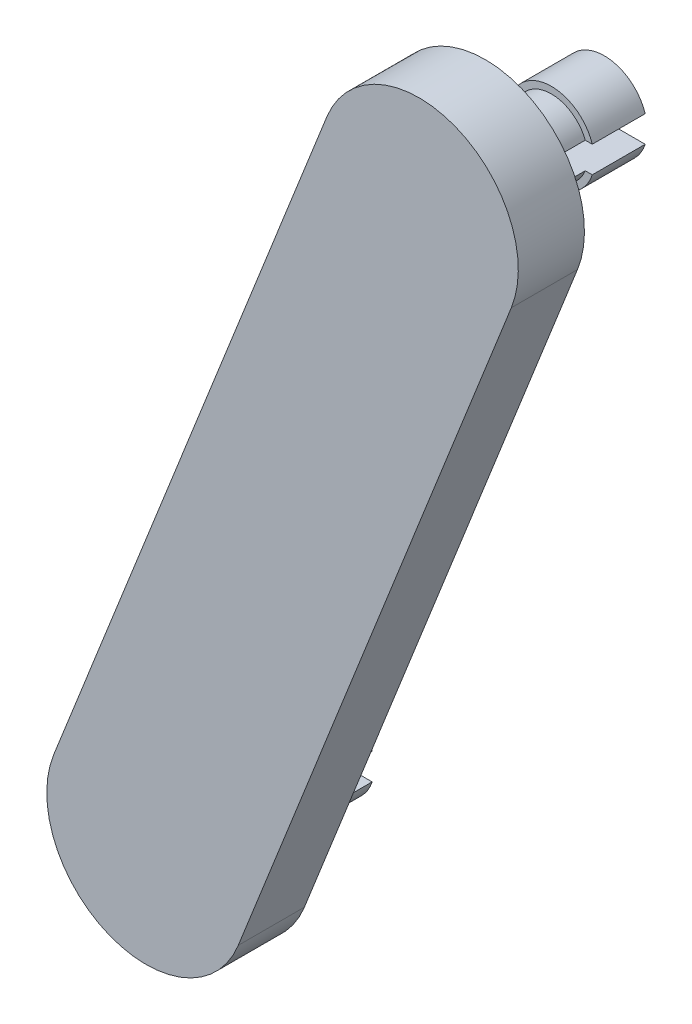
ISO-10303-21;
HEADER;
FILE_DESCRIPTION(('STEP AP214'),'2;1');
FILE_NAME('part.step','',(''),(''),'','','');
FILE_SCHEMA(('AUTOMOTIVE_DESIGN { 1 0 10303 214 1 1 1 1 }'));
ENDSEC;
DATA;
#1=APPLICATION_CONTEXT('core data for automotive mechanical design processes');
#2=APPLICATION_PROTOCOL_DEFINITION('international standard','automotive_design',2000,#1);
#3=PRODUCT_CONTEXT('',#1,'mechanical');
#4=PRODUCT('Part','Part','',(#3));
#5=PRODUCT_RELATED_PRODUCT_CATEGORY('part','',(#4));
#6=PRODUCT_DEFINITION_FORMATION('','',#4);
#7=PRODUCT_DEFINITION_CONTEXT('part definition',#1,'design');
#8=PRODUCT_DEFINITION('design','',#6,#7);
#9=PRODUCT_DEFINITION_SHAPE('','',#8);
#10=(LENGTH_UNIT() NAMED_UNIT(*) SI_UNIT(.MILLI.,.METRE.));
#11=(NAMED_UNIT(*) PLANE_ANGLE_UNIT() SI_UNIT($,.RADIAN.));
#12=(NAMED_UNIT(*) SI_UNIT($,.STERADIAN.) SOLID_ANGLE_UNIT());
#13=UNCERTAINTY_MEASURE_WITH_UNIT(LENGTH_MEASURE(1.E-05),#10,'distance_accuracy_value','');
#14=(GEOMETRIC_REPRESENTATION_CONTEXT(3) GLOBAL_UNCERTAINTY_ASSIGNED_CONTEXT((#13)) GLOBAL_UNIT_ASSIGNED_CONTEXT((#10,
#11,#12)) REPRESENTATION_CONTEXT('',''));
#15=CARTESIAN_POINT('',(0.,0.,0.));
#16=DIRECTION('',(0.,0.,1.));
#17=DIRECTION('',(1.,0.,0.));
#18=AXIS2_PLACEMENT_3D('',#15,#16,#17);
#19=CARTESIAN_POINT('',(-117.669847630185,11.9858517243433,-5.));
#20=DIRECTION('',(0.,0.,1.));
#21=DIRECTION('',(1.,0.,0.));
#22=AXIS2_PLACEMENT_3D('',#19,#20,#21);
#23=CYLINDRICAL_SURFACE('',#22,2.75000000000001);
#24=DIRECTION('',(0.,0.,1.));
#25=VECTOR('',#24,1.);
#26=CARTESIAN_POINT('',(-120.231585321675,12.9858517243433,-5.));
#27=LINE('',#26,#25);
#28=CARTESIAN_POINT('',(-120.231585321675,12.9858517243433,0.));
#29=VERTEX_POINT('',#28);
#30=CARTESIAN_POINT('',(-120.231585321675,12.9858517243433,-5.));
#31=VERTEX_POINT('',#30);
#32=EDGE_CURVE('E194',#29,#31,#27,.F.);
#33=ORIENTED_EDGE('',*,*,#32,.F.);
#34=CARTESIAN_POINT('',(-117.669847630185,11.9858517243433,0.));
#35=DIRECTION('',(0.,0.,1.));
#36=DIRECTION('',(1.,0.,0.));
#37=AXIS2_PLACEMENT_3D('',#34,#35,#36);
#38=CIRCLE('',#37,2.75000000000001);
#39=CARTESIAN_POINT('',(-115.108109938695,12.9858517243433,0.));
#40=VERTEX_POINT('',#39);
#41=EDGE_CURVE('E224',#40,#29,#38,.T.);
#42=ORIENTED_EDGE('',*,*,#41,.F.);
#43=DIRECTION('',(0.,0.,1.));
#44=VECTOR('',#43,1.);
#45=CARTESIAN_POINT('',(-115.108109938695,12.9858517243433,-5.));
#46=LINE('',#45,#44);
#47=CARTESIAN_POINT('',(-115.108109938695,12.9858517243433,-5.));
#48=VERTEX_POINT('',#47);
#49=EDGE_CURVE('E305',#48,#40,#46,.T.);
#50=ORIENTED_EDGE('',*,*,#49,.F.);
#51=CARTESIAN_POINT('',(-117.669847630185,11.9858517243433,-5.));
#52=DIRECTION('',(0.,0.,1.));
#53=DIRECTION('',(1.,0.,0.));
#54=AXIS2_PLACEMENT_3D('',#51,#52,#53);
#55=CIRCLE('',#54,2.75000000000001);
#56=EDGE_CURVE('E221',#48,#31,#55,.T.);
#57=ORIENTED_EDGE('',*,*,#56,.T.);
#58=EDGE_LOOP('',(#33,#42,#50,#57));
#59=FACE_BOUND('',#58,.T.);
#60=ADVANCED_FACE('F37',(#59),#23,.T.);
#61=CARTESIAN_POINT('',(-138.309294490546,-40.0719357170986,-5.));
#62=DIRECTION('',(0.,0.,1.));
#63=DIRECTION('',(1.,0.,0.));
#64=AXIS2_PLACEMENT_3D('',#61,#62,#63);
#65=CYLINDRICAL_SURFACE('',#64,2.75000000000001);
#66=DIRECTION('',(0.,0.,1.));
#67=VECTOR('',#66,1.);
#68=CARTESIAN_POINT('',(-140.871032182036,-39.0719357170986,-5.));
#69=LINE('',#68,#67);
#70=CARTESIAN_POINT('',(-140.871032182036,-39.0719357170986,0.));
#71=VERTEX_POINT('',#70);
#72=CARTESIAN_POINT('',(-140.871032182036,-39.0719357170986,-5.));
#73=VERTEX_POINT('',#72);
#74=EDGE_CURVE('E282',#71,#73,#69,.F.);
#75=ORIENTED_EDGE('',*,*,#74,.F.);
#76=CARTESIAN_POINT('',(-138.309294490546,-40.0719357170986,0.));
#77=DIRECTION('',(0.,0.,1.));
#78=DIRECTION('',(1.,0.,0.));
#79=AXIS2_PLACEMENT_3D('',#76,#77,#78);
#80=CIRCLE('',#79,2.75000000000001);
#81=CARTESIAN_POINT('',(-135.747556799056,-39.0719357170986,0.));
#82=VERTEX_POINT('',#81);
#83=EDGE_CURVE('E212',#82,#71,#80,.T.);
#84=ORIENTED_EDGE('',*,*,#83,.F.);
#85=DIRECTION('',(0.,0.,1.));
#86=VECTOR('',#85,1.);
#87=CARTESIAN_POINT('',(-135.747556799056,-39.0719357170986,-5.));
#88=LINE('',#87,#86);
#89=CARTESIAN_POINT('',(-135.747556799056,-39.0719357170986,-5.));
#90=VERTEX_POINT('',#89);
#91=EDGE_CURVE('E283',#90,#82,#88,.T.);
#92=ORIENTED_EDGE('',*,*,#91,.F.);
#93=CARTESIAN_POINT('',(-138.309294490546,-40.0719357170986,-5.));
#94=DIRECTION('',(0.,0.,1.));
#95=DIRECTION('',(1.,0.,0.));
#96=AXIS2_PLACEMENT_3D('',#93,#94,#95);
#97=CIRCLE('',#96,2.75000000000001);
#98=EDGE_CURVE('E217',#90,#73,#97,.T.);
#99=ORIENTED_EDGE('',*,*,#98,.T.);
#100=EDGE_LOOP('',(#75,#84,#92,#99));
#101=FACE_BOUND('',#100,.T.);
#102=ADVANCED_FACE('F280',(#101),#65,.T.);
#103=CARTESIAN_POINT('',(-117.669847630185,11.9858517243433,-9.));
#104=DIRECTION('',(0.,0.,1.));
#105=DIRECTION('',(1.,0.,0.));
#106=AXIS2_PLACEMENT_3D('',#103,#104,#105);
#107=CYLINDRICAL_SURFACE('',#106,3.25000000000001);
#108=CARTESIAN_POINT('',(-117.669847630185,11.9858517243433,-9.));
#109=DIRECTION('',(0.,0.,-1.));
#110=DIRECTION('',(-1.,0.,0.));
#111=AXIS2_PLACEMENT_3D('',#108,#109,#110);
#112=CIRCLE('',#111,3.25000000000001);
#113=CARTESIAN_POINT('',(-120.762176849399,12.9858517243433,-9.));
#114=VERTEX_POINT('',#113);
#115=CARTESIAN_POINT('',(-114.577518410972,12.9858517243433,-9.));
#116=VERTEX_POINT('',#115);
#117=EDGE_CURVE('E203',#114,#116,#112,.T.);
#118=ORIENTED_EDGE('',*,*,#117,.F.);
#119=DIRECTION('',(0.,0.,1.));
#120=VECTOR('',#119,1.);
#121=CARTESIAN_POINT('',(-120.762176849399,12.9858517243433,-9.));
#122=LINE('',#121,#120);
#123=CARTESIAN_POINT('',(-120.762176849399,12.9858517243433,-5.));
#124=VERTEX_POINT('',#123);
#125=EDGE_CURVE('E198',#114,#124,#122,.T.);
#126=ORIENTED_EDGE('',*,*,#125,.T.);
#127=CARTESIAN_POINT('',(-117.669847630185,11.9858517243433,-5.));
#128=DIRECTION('',(0.,0.,-1.));
#129=DIRECTION('',(-1.,0.,0.));
#130=AXIS2_PLACEMENT_3D('',#127,#128,#129);
#131=CIRCLE('',#130,3.25000000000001);
#132=CARTESIAN_POINT('',(-114.577518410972,12.9858517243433,-5.));
#133=VERTEX_POINT('',#132);
#134=EDGE_CURVE('E208',#124,#133,#131,.T.);
#135=ORIENTED_EDGE('',*,*,#134,.T.);
#136=DIRECTION('',(0.,0.,1.));
#137=VECTOR('',#136,1.);
#138=CARTESIAN_POINT('',(-114.577518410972,12.9858517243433,-9.));
#139=LINE('',#138,#137);
#140=EDGE_CURVE('E302',#133,#116,#139,.F.);
#141=ORIENTED_EDGE('',*,*,#140,.T.);
#142=EDGE_LOOP('',(#118,#126,#135,#141));
#143=FACE_BOUND('',#142,.T.);
#144=ADVANCED_FACE('F311',(#143),#107,.T.);
#145=CARTESIAN_POINT('',(-117.669847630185,11.9858517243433,-9.));
#146=DIRECTION('',(0.,0.,-1.));
#147=DIRECTION('',(-1.,0.,0.));
#148=AXIS2_PLACEMENT_3D('',#145,#146,#147);
#149=PLANE('',#148);
#150=DIRECTION('',(1.,0.,0.));
#151=VECTOR('',#150,1.);
#152=CARTESIAN_POINT('',(-112.669847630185,12.9858517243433,-9.));
#153=LINE('',#152,#151);
#154=EDGE_CURVE('E331',#114,#116,#153,.T.);
#155=ORIENTED_EDGE('',*,*,#154,.F.);
#156=ORIENTED_EDGE('',*,*,#117,.T.);
#157=EDGE_LOOP('',(#155,#156));
#158=FACE_BOUND('',#157,.T.);
#159=ADVANCED_FACE('F371',(#158),#149,.T.);
#160=CARTESIAN_POINT('',(-117.669847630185,11.9858517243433,-5.));
#161=DIRECTION('',(0.,0.,-1.));
#162=DIRECTION('',(-1.,0.,0.));
#163=AXIS2_PLACEMENT_3D('',#160,#161,#162);
#164=PLANE('',#163);
#165=ORIENTED_EDGE('',*,*,#134,.F.);
#166=DIRECTION('',(1.,0.,0.));
#167=VECTOR('',#166,1.);
#168=CARTESIAN_POINT('',(-117.669847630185,12.9858517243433,-5.));
#169=LINE('',#168,#167);
#170=EDGE_CURVE('E11',#124,#31,#169,.T.);
#171=ORIENTED_EDGE('',*,*,#170,.T.);
#172=ORIENTED_EDGE('',*,*,#56,.F.);
#173=EDGE_CURVE('E41',#48,#133,#169,.T.);
#174=ORIENTED_EDGE('',*,*,#173,.T.);
#175=EDGE_LOOP('',(#165,#171,#172,#174));
#176=FACE_BOUND('',#175,.T.);
#177=ADVANCED_FACE('F316',(#176),#164,.F.);
#178=CARTESIAN_POINT('',(-138.309294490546,-40.0719357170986,-9.));
#179=DIRECTION('',(0.,0.,1.));
#180=DIRECTION('',(1.,0.,0.));
#181=AXIS2_PLACEMENT_3D('',#178,#179,#180);
#182=CYLINDRICAL_SURFACE('',#181,3.25000000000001);
#183=CARTESIAN_POINT('',(-138.309294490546,-40.0719357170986,-9.));
#184=DIRECTION('',(0.,0.,-1.));
#185=DIRECTION('',(-1.,0.,0.));
#186=AXIS2_PLACEMENT_3D('',#183,#184,#185);
#187=CIRCLE('',#186,3.25000000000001);
#188=CARTESIAN_POINT('',(-141.401623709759,-39.0719357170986,-9.));
#189=VERTEX_POINT('',#188);
#190=CARTESIAN_POINT('',(-135.216965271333,-39.0719357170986,-9.));
#191=VERTEX_POINT('',#190);
#192=EDGE_CURVE('E193',#189,#191,#187,.T.);
#193=ORIENTED_EDGE('',*,*,#192,.F.);
#194=DIRECTION('',(0.,0.,1.));
#195=VECTOR('',#194,1.);
#196=CARTESIAN_POINT('',(-141.401623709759,-39.0719357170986,-9.));
#197=LINE('',#196,#195);
#198=CARTESIAN_POINT('',(-141.401623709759,-39.0719357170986,-5.));
#199=VERTEX_POINT('',#198);
#200=EDGE_CURVE('E285',#189,#199,#197,.T.);
#201=ORIENTED_EDGE('',*,*,#200,.T.);
#202=CARTESIAN_POINT('',(-138.309294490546,-40.0719357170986,-5.));
#203=DIRECTION('',(0.,0.,-1.));
#204=DIRECTION('',(-1.,0.,0.));
#205=AXIS2_PLACEMENT_3D('',#202,#203,#204);
#206=CIRCLE('',#205,3.25000000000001);
#207=CARTESIAN_POINT('',(-135.216965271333,-39.0719357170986,-5.));
#208=VERTEX_POINT('',#207);
#209=EDGE_CURVE('E202',#199,#208,#206,.T.);
#210=ORIENTED_EDGE('',*,*,#209,.T.);
#211=DIRECTION('',(0.,0.,1.));
#212=VECTOR('',#211,1.);
#213=CARTESIAN_POINT('',(-135.216965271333,-39.0719357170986,-9.));
#214=LINE('',#213,#212);
#215=EDGE_CURVE('E286',#208,#191,#214,.F.);
#216=ORIENTED_EDGE('',*,*,#215,.T.);
#217=EDGE_LOOP('',(#193,#201,#210,#216));
#218=FACE_BOUND('',#217,.T.);
#219=ADVANCED_FACE('F352',(#218),#182,.T.);
#220=CARTESIAN_POINT('',(-138.309294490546,-40.0719357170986,-9.));
#221=DIRECTION('',(0.,0.,-1.));
#222=DIRECTION('',(-1.,0.,0.));
#223=AXIS2_PLACEMENT_3D('',#220,#221,#222);
#224=PLANE('',#223);
#225=DIRECTION('',(1.,0.,0.));
#226=VECTOR('',#225,1.);
#227=CARTESIAN_POINT('',(-133.309294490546,-39.0719357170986,-9.));
#228=LINE('',#227,#226);
#229=EDGE_CURVE('E189',#189,#191,#228,.T.);
#230=ORIENTED_EDGE('',*,*,#229,.F.);
#231=ORIENTED_EDGE('',*,*,#192,.T.);
#232=EDGE_LOOP('',(#230,#231));
#233=FACE_BOUND('',#232,.T.);
#234=ADVANCED_FACE('F356',(#233),#224,.T.);
#235=CARTESIAN_POINT('',(-138.309294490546,-40.0719357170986,-5.));
#236=DIRECTION('',(0.,0.,-1.));
#237=DIRECTION('',(-1.,0.,0.));
#238=AXIS2_PLACEMENT_3D('',#235,#236,#237);
#239=PLANE('',#238);
#240=ORIENTED_EDGE('',*,*,#209,.F.);
#241=DIRECTION('',(1.,0.,0.));
#242=VECTOR('',#241,1.);
#243=CARTESIAN_POINT('',(-138.309294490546,-39.0719357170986,-5.));
#244=LINE('',#243,#242);
#245=EDGE_CURVE('E261',#199,#73,#244,.T.);
#246=ORIENTED_EDGE('',*,*,#245,.T.);
#247=ORIENTED_EDGE('',*,*,#98,.F.);
#248=EDGE_CURVE('E259',#90,#208,#244,.T.);
#249=ORIENTED_EDGE('',*,*,#248,.T.);
#250=EDGE_LOOP('',(#240,#246,#247,#249));
#251=FACE_BOUND('',#250,.T.);
#252=ADVANCED_FACE('F273',(#251),#239,.F.);
#253=CARTESIAN_POINT('',(-138.309294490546,-40.0719357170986,5.));
#254=DIRECTION('',(0.,0.,-1.));
#255=DIRECTION('',(-1.,0.,0.));
#256=AXIS2_PLACEMENT_3D('',#253,#254,#255);
#257=CYLINDRICAL_SURFACE('',#256,7.50000000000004);
#258=CARTESIAN_POINT('',(-138.309294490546,-40.0719357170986,0.));
#259=DIRECTION('',(0.,0.,1.));
#260=DIRECTION('',(1.,0.,0.));
#261=AXIS2_PLACEMENT_3D('',#258,#259,#260);
#262=CIRCLE('',#261,7.50000000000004);
#263=CARTESIAN_POINT('',(-145.28131959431,-37.3077240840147,0.));
#264=VERTEX_POINT('',#263);
#265=CARTESIAN_POINT('',(-131.337269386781,-42.8361473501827,0.));
#266=VERTEX_POINT('',#265);
#267=EDGE_CURVE('E227',#264,#266,#262,.T.);
#268=ORIENTED_EDGE('',*,*,#267,.T.);
#269=DIRECTION('',(0.,0.,-1.));
#270=VECTOR('',#269,1.);
#271=CARTESIAN_POINT('',(-131.337269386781,-42.8361473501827,5.));
#272=LINE('',#271,#270);
#273=CARTESIAN_POINT('',(-131.337269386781,-42.8361473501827,5.));
#274=VERTEX_POINT('',#273);
#275=EDGE_CURVE('E254',#274,#266,#272,.T.);
#276=ORIENTED_EDGE('',*,*,#275,.F.);
#277=CARTESIAN_POINT('',(-138.309294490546,-40.0719357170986,5.));
#278=DIRECTION('',(0.,0.,1.));
#279=DIRECTION('',(1.,0.,0.));
#280=AXIS2_PLACEMENT_3D('',#277,#278,#279);
#281=CIRCLE('',#280,7.50000000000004);
#282=CARTESIAN_POINT('',(-145.28131959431,-37.3077240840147,5.));
#283=VERTEX_POINT('',#282);
#284=EDGE_CURVE('E228',#283,#274,#281,.T.);
#285=ORIENTED_EDGE('',*,*,#284,.F.);
#286=DIRECTION('',(0.,0.,-1.));
#287=VECTOR('',#286,1.);
#288=CARTESIAN_POINT('',(-145.28131959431,-37.3077240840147,5.));
#289=LINE('',#288,#287);
#290=EDGE_CURVE('E238',#283,#264,#289,.T.);
#291=ORIENTED_EDGE('',*,*,#290,.T.);
#292=EDGE_LOOP('',(#268,#276,#285,#291));
#293=FACE_BOUND('',#292,.T.);
#294=ADVANCED_FACE('F39',(#293),#257,.T.);
#295=CARTESIAN_POINT('',(-131.337269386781,-42.8361473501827,5.));
#296=DIRECTION('',(-0.929603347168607,0.368561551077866,0.));
#297=DIRECTION('',(-0.368561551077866,-0.929603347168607,0.));
#298=AXIS2_PLACEMENT_3D('',#295,#296,#297);
#299=PLANE('',#298);
#300=DIRECTION('',(0.368561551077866,0.929603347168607,0.));
#301=VECTOR('',#300,1.);
#302=CARTESIAN_POINT('',(-131.337269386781,-42.8361473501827,0.));
#303=LINE('',#302,#301);
#304=CARTESIAN_POINT('',(-110.697822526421,9.22164009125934,0.));
#305=VERTEX_POINT('',#304);
#306=EDGE_CURVE('E241',#266,#305,#303,.T.);
#307=ORIENTED_EDGE('',*,*,#306,.T.);
#308=DIRECTION('',(0.,0.,-1.));
#309=VECTOR('',#308,1.);
#310=CARTESIAN_POINT('',(-110.697822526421,9.22164009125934,5.));
#311=LINE('',#310,#309);
#312=CARTESIAN_POINT('',(-110.697822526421,9.22164009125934,5.));
#313=VERTEX_POINT('',#312);
#314=EDGE_CURVE('E251',#313,#305,#311,.T.);
#315=ORIENTED_EDGE('',*,*,#314,.F.);
#316=DIRECTION('',(0.368561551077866,0.929603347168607,0.));
#317=VECTOR('',#316,1.);
#318=CARTESIAN_POINT('',(-131.337269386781,-42.8361473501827,5.));
#319=LINE('',#318,#317);
#320=EDGE_CURVE('E231',#274,#313,#319,.T.);
#321=ORIENTED_EDGE('',*,*,#320,.F.);
#322=ORIENTED_EDGE('',*,*,#275,.T.);
#323=EDGE_LOOP('',(#307,#315,#321,#322));
#324=FACE_BOUND('',#323,.T.);
#325=ADVANCED_FACE('F420',(#324),#299,.F.);
#326=CARTESIAN_POINT('',(-117.669847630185,11.9858517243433,5.));
#327=DIRECTION('',(0.,0.,-1.));
#328=DIRECTION('',(-1.,0.,0.));
#329=AXIS2_PLACEMENT_3D('',#326,#327,#328);
#330=CYLINDRICAL_SURFACE('',#329,7.50000000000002);
#331=CARTESIAN_POINT('',(-117.669847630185,11.9858517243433,0.));
#332=DIRECTION('',(0.,0.,1.));
#333=DIRECTION('',(1.,0.,0.));
#334=AXIS2_PLACEMENT_3D('',#331,#332,#333);
#335=CIRCLE('',#334,7.50000000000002);
#336=CARTESIAN_POINT('',(-124.64187273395,14.7500633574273,0.));
#337=VERTEX_POINT('',#336);
#338=EDGE_CURVE('E243',#305,#337,#335,.T.);
#339=ORIENTED_EDGE('',*,*,#338,.T.);
#340=DIRECTION('',(0.,0.,-1.));
#341=VECTOR('',#340,1.);
#342=CARTESIAN_POINT('',(-124.64187273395,14.7500633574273,5.));
#343=LINE('',#342,#341);
#344=CARTESIAN_POINT('',(-124.64187273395,14.7500633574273,5.));
#345=VERTEX_POINT('',#344);
#346=EDGE_CURVE('E248',#345,#337,#343,.T.);
#347=ORIENTED_EDGE('',*,*,#346,.F.);
#348=CARTESIAN_POINT('',(-117.669847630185,11.9858517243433,5.));
#349=DIRECTION('',(0.,0.,1.));
#350=DIRECTION('',(1.,0.,0.));
#351=AXIS2_PLACEMENT_3D('',#348,#349,#350);
#352=CIRCLE('',#351,7.50000000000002);
#353=EDGE_CURVE('E234',#313,#345,#352,.T.);
#354=ORIENTED_EDGE('',*,*,#353,.F.);
#355=ORIENTED_EDGE('',*,*,#314,.T.);
#356=EDGE_LOOP('',(#339,#347,#354,#355));
#357=FACE_BOUND('',#356,.T.);
#358=ADVANCED_FACE('F417',(#357),#330,.T.);
#359=CARTESIAN_POINT('',(-145.28131959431,-37.3077240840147,5.));
#360=DIRECTION('',(0.929603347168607,-0.368561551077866,0.));
#361=DIRECTION('',(0.368561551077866,0.929603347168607,0.));
#362=AXIS2_PLACEMENT_3D('',#359,#360,#361);
#363=PLANE('',#362);
#364=DIRECTION('',(-0.368561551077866,-0.929603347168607,0.));
#365=VECTOR('',#364,1.);
#366=CARTESIAN_POINT('',(-145.28131959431,-37.3077240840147,0.));
#367=LINE('',#366,#365);
#368=EDGE_CURVE('E232',#337,#264,#367,.T.);
#369=ORIENTED_EDGE('',*,*,#368,.T.);
#370=ORIENTED_EDGE('',*,*,#290,.F.);
#371=DIRECTION('',(-0.368561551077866,-0.929603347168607,0.));
#372=VECTOR('',#371,1.);
#373=CARTESIAN_POINT('',(-145.28131959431,-37.3077240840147,5.));
#374=LINE('',#373,#372);
#375=EDGE_CURVE('E236',#345,#283,#374,.T.);
#376=ORIENTED_EDGE('',*,*,#375,.F.);
#377=ORIENTED_EDGE('',*,*,#346,.T.);
#378=EDGE_LOOP('',(#369,#370,#376,#377));
#379=FACE_BOUND('',#378,.T.);
#380=ADVANCED_FACE('F413',(#379),#363,.F.);
#381=CARTESIAN_POINT('',(-138.309294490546,-40.0719357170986,5.));
#382=DIRECTION('',(0.,0.,1.));
#383=DIRECTION('',(1.,0.,0.));
#384=AXIS2_PLACEMENT_3D('',#381,#382,#383);
#385=PLANE('',#384);
#386=ORIENTED_EDGE('',*,*,#284,.T.);
#387=ORIENTED_EDGE('',*,*,#320,.T.);
#388=ORIENTED_EDGE('',*,*,#353,.T.);
#389=ORIENTED_EDGE('',*,*,#375,.T.);
#390=EDGE_LOOP('',(#386,#387,#388,#389));
#391=FACE_BOUND('',#390,.T.);
#392=ADVANCED_FACE('F395',(#391),#385,.T.);
#393=CARTESIAN_POINT('',(-138.309294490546,-40.0719357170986,0.));
#394=DIRECTION('',(0.,0.,1.));
#395=DIRECTION('',(1.,0.,0.));
#396=AXIS2_PLACEMENT_3D('',#393,#394,#395);
#397=PLANE('',#396);
#398=DIRECTION('',(1.,0.,0.));
#399=VECTOR('',#398,1.);
#400=CARTESIAN_POINT('',(-133.309294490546,-39.0719357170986,0.));
#401=LINE('',#400,#399);
#402=EDGE_CURVE('E337',#71,#82,#401,.T.);
#403=ORIENTED_EDGE('',*,*,#402,.T.);
#404=ORIENTED_EDGE('',*,*,#83,.T.);
#405=EDGE_LOOP('',(#403,#404));
#406=FACE_BOUND('',#405,.T.);
#407=DIRECTION('',(-1.,0.,0.));
#408=VECTOR('',#407,1.);
#409=CARTESIAN_POINT('',(-133.309294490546,-41.0719357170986,0.));
#410=LINE('',#409,#408);
#411=CARTESIAN_POINT('',(-135.747556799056,-41.0719357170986,0.));
#412=VERTEX_POINT('',#411);
#413=CARTESIAN_POINT('',(-140.871032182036,-41.0719357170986,0.));
#414=VERTEX_POINT('',#413);
#415=EDGE_CURVE('E340',#412,#414,#410,.T.);
#416=ORIENTED_EDGE('',*,*,#415,.T.);
#417=EDGE_CURVE('E216',#414,#412,#80,.T.);
#418=ORIENTED_EDGE('',*,*,#417,.T.);
#419=EDGE_LOOP('',(#416,#418));
#420=FACE_BOUND('',#419,.T.);
#421=DIRECTION('',(1.,0.,0.));
#422=VECTOR('',#421,1.);
#423=CARTESIAN_POINT('',(-112.669847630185,12.9858517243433,0.));
#424=LINE('',#423,#422);
#425=EDGE_CURVE('E327',#29,#40,#424,.T.);
#426=ORIENTED_EDGE('',*,*,#425,.T.);
#427=ORIENTED_EDGE('',*,*,#41,.T.);
#428=EDGE_LOOP('',(#426,#427));
#429=FACE_BOUND('',#428,.T.);
#430=DIRECTION('',(-1.,0.,0.));
#431=VECTOR('',#430,1.);
#432=CARTESIAN_POINT('',(-112.669847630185,10.9858517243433,0.));
#433=LINE('',#432,#431);
#434=CARTESIAN_POINT('',(-115.108109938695,10.9858517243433,0.));
#435=VERTEX_POINT('',#434);
#436=CARTESIAN_POINT('',(-120.231585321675,10.9858517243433,0.));
#437=VERTEX_POINT('',#436);
#438=EDGE_CURVE('E328',#435,#437,#433,.T.);
#439=ORIENTED_EDGE('',*,*,#438,.T.);
#440=EDGE_CURVE('E215',#437,#435,#38,.T.);
#441=ORIENTED_EDGE('',*,*,#440,.T.);
#442=EDGE_LOOP('',(#439,#441));
#443=FACE_BOUND('',#442,.T.);
#444=ORIENTED_EDGE('',*,*,#267,.F.);
#445=ORIENTED_EDGE('',*,*,#368,.F.);
#446=ORIENTED_EDGE('',*,*,#338,.F.);
#447=ORIENTED_EDGE('',*,*,#306,.F.);
#448=EDGE_LOOP('',(#444,#445,#446,#447));
#449=FACE_BOUND('',#448,.T.);
#450=ADVANCED_FACE('F325',(#406,#420,#429,#443,#449),#397,.F.);
#451=DIRECTION('',(0.,0.,1.));
#452=VECTOR('',#451,1.);
#453=CARTESIAN_POINT('',(-115.108109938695,10.9858517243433,-5.));
#454=LINE('',#453,#452);
#455=CARTESIAN_POINT('',(-115.108109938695,10.9858517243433,-5.));
#456=VERTEX_POINT('',#455);
#457=EDGE_CURVE('E300',#435,#456,#454,.F.);
#458=ORIENTED_EDGE('',*,*,#457,.F.);
#459=ORIENTED_EDGE('',*,*,#440,.F.);
#460=DIRECTION('',(0.,0.,1.));
#461=VECTOR('',#460,1.);
#462=CARTESIAN_POINT('',(-120.231585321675,10.9858517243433,-5.));
#463=LINE('',#462,#461);
#464=CARTESIAN_POINT('',(-120.231585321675,10.9858517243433,-5.));
#465=VERTEX_POINT('',#464);
#466=EDGE_CURVE('E295',#465,#437,#463,.T.);
#467=ORIENTED_EDGE('',*,*,#466,.F.);
#468=EDGE_CURVE('E206',#465,#456,#55,.T.);
#469=ORIENTED_EDGE('',*,*,#468,.T.);
#470=EDGE_LOOP('',(#458,#459,#467,#469));
#471=FACE_BOUND('',#470,.T.);
#472=ADVANCED_FACE('F383',(#471),#23,.T.);
#473=DIRECTION('',(0.,0.,1.));
#474=VECTOR('',#473,1.);
#475=CARTESIAN_POINT('',(-135.747556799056,-41.0719357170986,-5.));
#476=LINE('',#475,#474);
#477=CARTESIAN_POINT('',(-135.747556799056,-41.0719357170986,-5.));
#478=VERTEX_POINT('',#477);
#479=EDGE_CURVE('E182',#412,#478,#476,.F.);
#480=ORIENTED_EDGE('',*,*,#479,.F.);
#481=ORIENTED_EDGE('',*,*,#417,.F.);
#482=DIRECTION('',(0.,0.,1.));
#483=VECTOR('',#482,1.);
#484=CARTESIAN_POINT('',(-140.871032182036,-41.0719357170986,-5.));
#485=LINE('',#484,#483);
#486=CARTESIAN_POINT('',(-140.871032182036,-41.0719357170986,-5.));
#487=VERTEX_POINT('',#486);
#488=EDGE_CURVE('E183',#487,#414,#485,.T.);
#489=ORIENTED_EDGE('',*,*,#488,.F.);
#490=EDGE_CURVE('E220',#487,#478,#97,.T.);
#491=ORIENTED_EDGE('',*,*,#490,.T.);
#492=EDGE_LOOP('',(#480,#481,#489,#491));
#493=FACE_BOUND('',#492,.T.);
#494=ADVANCED_FACE('F349',(#493),#65,.T.);
#495=CARTESIAN_POINT('',(-114.577518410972,10.9858517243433,-9.));
#496=VERTEX_POINT('',#495);
#497=CARTESIAN_POINT('',(-120.762176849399,10.9858517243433,-9.));
#498=VERTEX_POINT('',#497);
#499=EDGE_CURVE('E207',#496,#498,#112,.T.);
#500=ORIENTED_EDGE('',*,*,#499,.F.);
#501=DIRECTION('',(0.,0.,1.));
#502=VECTOR('',#501,1.);
#503=CARTESIAN_POINT('',(-114.577518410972,10.9858517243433,-9.));
#504=LINE('',#503,#502);
#505=CARTESIAN_POINT('',(-114.577518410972,10.9858517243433,-5.));
#506=VERTEX_POINT('',#505);
#507=EDGE_CURVE('E297',#496,#506,#504,.T.);
#508=ORIENTED_EDGE('',*,*,#507,.T.);
#509=CARTESIAN_POINT('',(-120.762176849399,10.9858517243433,-5.));
#510=VERTEX_POINT('',#509);
#511=EDGE_CURVE('E211',#506,#510,#131,.T.);
#512=ORIENTED_EDGE('',*,*,#511,.T.);
#513=DIRECTION('',(0.,0.,1.));
#514=VECTOR('',#513,1.);
#515=CARTESIAN_POINT('',(-120.762176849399,10.9858517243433,-9.));
#516=LINE('',#515,#514);
#517=EDGE_CURVE('E52',#510,#498,#516,.F.);
#518=ORIENTED_EDGE('',*,*,#517,.T.);
#519=EDGE_LOOP('',(#500,#508,#512,#518));
#520=FACE_BOUND('',#519,.T.);
#521=ADVANCED_FACE('F366',(#520),#107,.T.);
#522=DIRECTION('',(-1.,0.,0.));
#523=VECTOR('',#522,1.);
#524=CARTESIAN_POINT('',(-112.669847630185,10.9858517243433,-9.));
#525=LINE('',#524,#523);
#526=EDGE_CURVE('E190',#496,#498,#525,.T.);
#527=ORIENTED_EDGE('',*,*,#526,.F.);
#528=ORIENTED_EDGE('',*,*,#499,.T.);
#529=EDGE_LOOP('',(#527,#528));
#530=FACE_BOUND('',#529,.T.);
#531=ADVANCED_FACE('F367',(#530),#149,.T.);
#532=ORIENTED_EDGE('',*,*,#511,.F.);
#533=DIRECTION('',(-1.,0.,0.));
#534=VECTOR('',#533,1.);
#535=CARTESIAN_POINT('',(-117.669847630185,10.9858517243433,-5.));
#536=LINE('',#535,#534);
#537=EDGE_CURVE('E263',#506,#456,#536,.T.);
#538=ORIENTED_EDGE('',*,*,#537,.T.);
#539=ORIENTED_EDGE('',*,*,#468,.F.);
#540=EDGE_CURVE('E262',#465,#510,#536,.T.);
#541=ORIENTED_EDGE('',*,*,#540,.T.);
#542=EDGE_LOOP('',(#532,#538,#539,#541));
#543=FACE_BOUND('',#542,.T.);
#544=ADVANCED_FACE('F369',(#543),#164,.F.);
#545=CARTESIAN_POINT('',(-135.216965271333,-41.0719357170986,-9.));
#546=VERTEX_POINT('',#545);
#547=CARTESIAN_POINT('',(-141.401623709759,-41.0719357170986,-9.));
#548=VERTEX_POINT('',#547);
#549=EDGE_CURVE('E188',#546,#548,#187,.T.);
#550=ORIENTED_EDGE('',*,*,#549,.F.);
#551=DIRECTION('',(0.,0.,1.));
#552=VECTOR('',#551,1.);
#553=CARTESIAN_POINT('',(-135.216965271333,-41.0719357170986,-9.));
#554=LINE('',#553,#552);
#555=CARTESIAN_POINT('',(-135.216965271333,-41.0719357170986,-5.));
#556=VERTEX_POINT('',#555);
#557=EDGE_CURVE('E172',#546,#556,#554,.T.);
#558=ORIENTED_EDGE('',*,*,#557,.T.);
#559=CARTESIAN_POINT('',(-141.401623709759,-41.0719357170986,-5.));
#560=VERTEX_POINT('',#559);
#561=EDGE_CURVE('E197',#556,#560,#206,.T.);
#562=ORIENTED_EDGE('',*,*,#561,.T.);
#563=DIRECTION('',(0.,0.,1.));
#564=VECTOR('',#563,1.);
#565=CARTESIAN_POINT('',(-141.401623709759,-41.0719357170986,-9.));
#566=LINE('',#565,#564);
#567=EDGE_CURVE('E60',#560,#548,#566,.F.);
#568=ORIENTED_EDGE('',*,*,#567,.T.);
#569=EDGE_LOOP('',(#550,#558,#562,#568));
#570=FACE_BOUND('',#569,.T.);
#571=ADVANCED_FACE('F192',(#570),#182,.T.);
#572=DIRECTION('',(-1.,0.,0.));
#573=VECTOR('',#572,1.);
#574=CARTESIAN_POINT('',(-133.309294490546,-41.0719357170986,-9.));
#575=LINE('',#574,#573);
#576=EDGE_CURVE('E175',#546,#548,#575,.T.);
#577=ORIENTED_EDGE('',*,*,#576,.F.);
#578=ORIENTED_EDGE('',*,*,#549,.T.);
#579=EDGE_LOOP('',(#577,#578));
#580=FACE_BOUND('',#579,.T.);
#581=ADVANCED_FACE('F187',(#580),#224,.T.);
#582=ORIENTED_EDGE('',*,*,#561,.F.);
#583=DIRECTION('',(-1.,0.,0.));
#584=VECTOR('',#583,1.);
#585=CARTESIAN_POINT('',(-138.309294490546,-41.0719357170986,-5.));
#586=LINE('',#585,#584);
#587=EDGE_CURVE('E177',#556,#478,#586,.T.);
#588=ORIENTED_EDGE('',*,*,#587,.T.);
#589=ORIENTED_EDGE('',*,*,#490,.F.);
#590=EDGE_CURVE('E257',#487,#560,#586,.T.);
#591=ORIENTED_EDGE('',*,*,#590,.T.);
#592=EDGE_LOOP('',(#582,#588,#589,#591));
#593=FACE_BOUND('',#592,.T.);
#594=ADVANCED_FACE('F347',(#593),#239,.F.);
#595=CARTESIAN_POINT('',(-133.309294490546,-39.0719357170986,0.));
#596=DIRECTION('',(0.,1.,0.));
#597=DIRECTION('',(0.,0.,1.));
#598=AXIS2_PLACEMENT_3D('',#595,#596,#597);
#599=PLANE('',#598);
#600=ORIENTED_EDGE('',*,*,#74,.T.);
#601=ORIENTED_EDGE('',*,*,#245,.F.);
#602=ORIENTED_EDGE('',*,*,#200,.F.);
#603=ORIENTED_EDGE('',*,*,#229,.T.);
#604=ORIENTED_EDGE('',*,*,#215,.F.);
#605=ORIENTED_EDGE('',*,*,#248,.F.);
#606=ORIENTED_EDGE('',*,*,#91,.T.);
#607=ORIENTED_EDGE('',*,*,#402,.F.);
#608=EDGE_LOOP('',(#600,#601,#602,#603,#604,#605,#606,#607));
#609=FACE_BOUND('',#608,.T.);
#610=ADVANCED_FACE('F354',(#609),#599,.F.);
#611=CARTESIAN_POINT('',(-133.309294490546,-41.0719357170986,0.));
#612=DIRECTION('',(0.,-1.,0.));
#613=DIRECTION('',(0.,0.,-1.));
#614=AXIS2_PLACEMENT_3D('',#611,#612,#613);
#615=PLANE('',#614);
#616=ORIENTED_EDGE('',*,*,#479,.T.);
#617=ORIENTED_EDGE('',*,*,#587,.F.);
#618=ORIENTED_EDGE('',*,*,#557,.F.);
#619=ORIENTED_EDGE('',*,*,#576,.T.);
#620=ORIENTED_EDGE('',*,*,#567,.F.);
#621=ORIENTED_EDGE('',*,*,#590,.F.);
#622=ORIENTED_EDGE('',*,*,#488,.T.);
#623=ORIENTED_EDGE('',*,*,#415,.F.);
#624=EDGE_LOOP('',(#616,#617,#618,#619,#620,#621,#622,#623));
#625=FACE_BOUND('',#624,.T.);
#626=ADVANCED_FACE('F174',(#625),#615,.F.);
#627=CARTESIAN_POINT('',(-112.669847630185,12.9858517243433,0.));
#628=DIRECTION('',(0.,1.,0.));
#629=DIRECTION('',(0.,0.,1.));
#630=AXIS2_PLACEMENT_3D('',#627,#628,#629);
#631=PLANE('',#630);
#632=ORIENTED_EDGE('',*,*,#32,.T.);
#633=ORIENTED_EDGE('',*,*,#170,.F.);
#634=ORIENTED_EDGE('',*,*,#125,.F.);
#635=ORIENTED_EDGE('',*,*,#154,.T.);
#636=ORIENTED_EDGE('',*,*,#140,.F.);
#637=ORIENTED_EDGE('',*,*,#173,.F.);
#638=ORIENTED_EDGE('',*,*,#49,.T.);
#639=ORIENTED_EDGE('',*,*,#425,.F.);
#640=EDGE_LOOP('',(#632,#633,#634,#635,#636,#637,#638,#639));
#641=FACE_BOUND('',#640,.T.);
#642=ADVANCED_FACE('F319',(#641),#631,.F.);
#643=CARTESIAN_POINT('',(-112.669847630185,10.9858517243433,0.));
#644=DIRECTION('',(0.,-1.,0.));
#645=DIRECTION('',(0.,0.,-1.));
#646=AXIS2_PLACEMENT_3D('',#643,#644,#645);
#647=PLANE('',#646);
#648=ORIENTED_EDGE('',*,*,#457,.T.);
#649=ORIENTED_EDGE('',*,*,#537,.F.);
#650=ORIENTED_EDGE('',*,*,#507,.F.);
#651=ORIENTED_EDGE('',*,*,#526,.T.);
#652=ORIENTED_EDGE('',*,*,#517,.F.);
#653=ORIENTED_EDGE('',*,*,#540,.F.);
#654=ORIENTED_EDGE('',*,*,#466,.T.);
#655=ORIENTED_EDGE('',*,*,#438,.F.);
#656=EDGE_LOOP('',(#648,#649,#650,#651,#652,#653,#654,#655));
#657=FACE_BOUND('',#656,.T.);
#658=ADVANCED_FACE('F361',(#657),#647,.F.);
#659=CLOSED_SHELL('',(#60,#102,#144,#159,#177,#219,#234,#252,#294,#325,#358,#380,#392,#450,#472,
#494,#521,#531,#544,#571,#581,#594,#610,#626,#642,#658));
#660=MANIFOLD_SOLID_BREP('B2',#659);
#661=ADVANCED_BREP_SHAPE_REPRESENTATION('',(#18,#660),#14);
#662=SHAPE_DEFINITION_REPRESENTATION(#9,#661);
ENDSEC;
END-ISO-10303-21;
